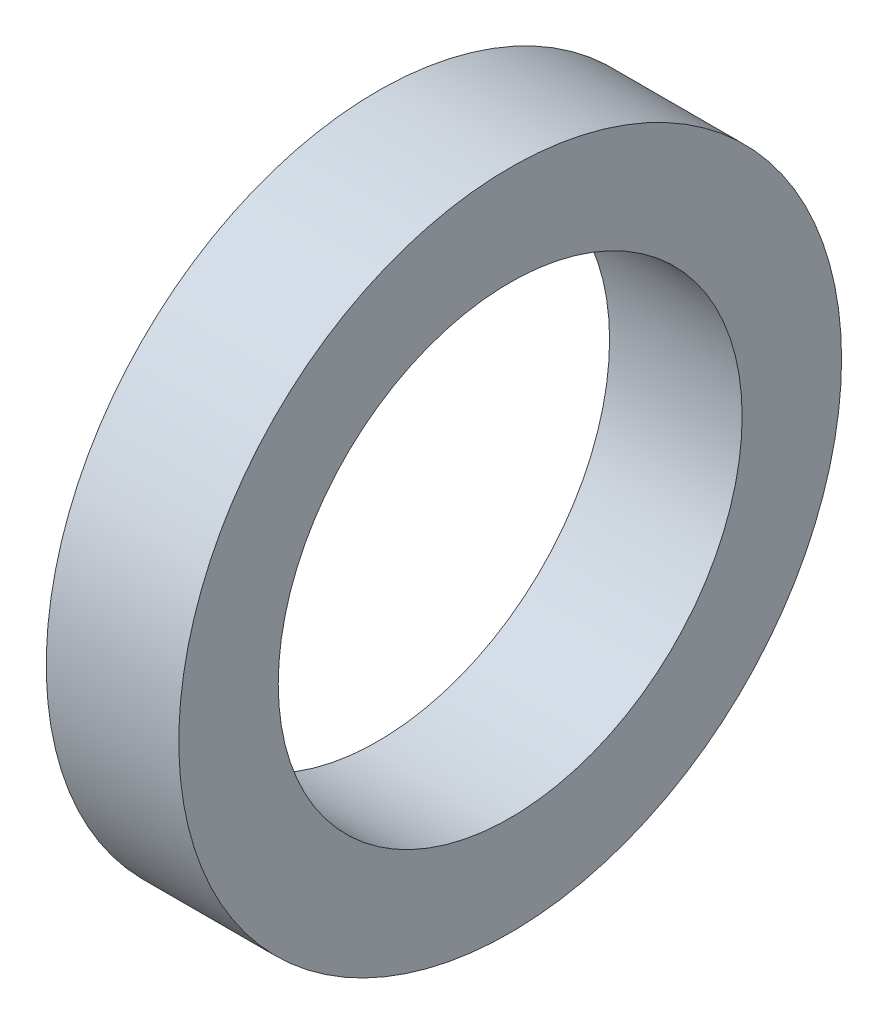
ISO-10303-21;
HEADER;
FILE_DESCRIPTION(('STEP AP214'),'2;1');
FILE_NAME('part.step','',(''),(''),'','','');
FILE_SCHEMA(('AUTOMOTIVE_DESIGN { 1 0 10303 214 1 1 1 1 }'));
ENDSEC;
DATA;
#1=APPLICATION_CONTEXT('core data for automotive mechanical design processes');
#2=APPLICATION_PROTOCOL_DEFINITION('international standard','automotive_design',2000,#1);
#3=PRODUCT_CONTEXT('',#1,'mechanical');
#4=PRODUCT('Part','Part','',(#3));
#5=PRODUCT_RELATED_PRODUCT_CATEGORY('part','',(#4));
#6=PRODUCT_DEFINITION_FORMATION('','',#4);
#7=PRODUCT_DEFINITION_CONTEXT('part definition',#1,'design');
#8=PRODUCT_DEFINITION('design','',#6,#7);
#9=PRODUCT_DEFINITION_SHAPE('','',#8);
#10=(LENGTH_UNIT() NAMED_UNIT(*) SI_UNIT(.MILLI.,.METRE.));
#11=(NAMED_UNIT(*) PLANE_ANGLE_UNIT() SI_UNIT($,.RADIAN.));
#12=(NAMED_UNIT(*) SI_UNIT($,.STERADIAN.) SOLID_ANGLE_UNIT());
#13=UNCERTAINTY_MEASURE_WITH_UNIT(LENGTH_MEASURE(1.E-05),#10,'distance_accuracy_value','');
#14=(GEOMETRIC_REPRESENTATION_CONTEXT(3) GLOBAL_UNCERTAINTY_ASSIGNED_CONTEXT((#13)) GLOBAL_UNIT_ASSIGNED_CONTEXT((#10,
#11,#12)) REPRESENTATION_CONTEXT('',''));
#15=CARTESIAN_POINT('',(0.,0.,0.));
#16=DIRECTION('',(0.,0.,1.));
#17=DIRECTION('',(1.,0.,0.));
#18=AXIS2_PLACEMENT_3D('',#15,#16,#17);
#19=CARTESIAN_POINT('',(3.,0.,0.));
#20=DIRECTION('',(1.,0.,0.));
#21=DIRECTION('',(0.,0.,-1.));
#22=AXIS2_PLACEMENT_3D('',#19,#20,#21);
#23=PLANE('',#22);
#24=CARTESIAN_POINT('',(3.,0.,0.));
#25=DIRECTION('',(1.,0.,0.));
#26=DIRECTION('',(0.,0.,-1.));
#27=AXIS2_PLACEMENT_3D('',#24,#25,#26);
#28=CIRCLE('',#27,5.25);
#29=CARTESIAN_POINT('',(3.,0.,-5.25));
#30=VERTEX_POINT('',#29);
#31=EDGE_CURVE('E28',#30,#30,#28,.F.);
#32=ORIENTED_EDGE('',*,*,#31,.T.);
#33=EDGE_LOOP('',(#32));
#34=FACE_BOUND('',#33,.T.);
#35=CARTESIAN_POINT('',(3.,0.,0.));
#36=DIRECTION('',(1.,0.,0.));
#37=DIRECTION('',(0.,0.,-1.));
#38=AXIS2_PLACEMENT_3D('',#35,#36,#37);
#39=CIRCLE('',#38,7.5);
#40=CARTESIAN_POINT('',(3.,0.,-7.5));
#41=VERTEX_POINT('',#40);
#42=EDGE_CURVE('E19',#41,#41,#39,.F.);
#43=ORIENTED_EDGE('',*,*,#42,.F.);
#44=EDGE_LOOP('',(#43));
#45=FACE_BOUND('',#44,.T.);
#46=ADVANCED_FACE('F15',(#34,#45),#23,.T.);
#47=CARTESIAN_POINT('',(0.,0.,0.));
#48=DIRECTION('',(1.,0.,0.));
#49=DIRECTION('',(0.,0.,-1.));
#50=AXIS2_PLACEMENT_3D('',#47,#48,#49);
#51=CYLINDRICAL_SURFACE('',#50,7.5);
#52=ORIENTED_EDGE('',*,*,#42,.T.);
#53=EDGE_LOOP('',(#52));
#54=FACE_BOUND('',#53,.T.);
#55=CARTESIAN_POINT('',(0.,0.,0.));
#56=DIRECTION('',(1.,0.,0.));
#57=DIRECTION('',(0.,0.,-1.));
#58=AXIS2_PLACEMENT_3D('',#55,#56,#57);
#59=CIRCLE('',#58,7.5);
#60=CARTESIAN_POINT('',(0.,0.,-7.5));
#61=VERTEX_POINT('',#60);
#62=EDGE_CURVE('E23',#61,#61,#59,.T.);
#63=ORIENTED_EDGE('',*,*,#62,.T.);
#64=EDGE_LOOP('',(#63));
#65=FACE_BOUND('',#64,.T.);
#66=ADVANCED_FACE('F36',(#54,#65),#51,.T.);
#67=CARTESIAN_POINT('',(0.,0.,0.));
#68=DIRECTION('',(1.,0.,0.));
#69=DIRECTION('',(0.,0.,-1.));
#70=AXIS2_PLACEMENT_3D('',#67,#68,#69);
#71=CYLINDRICAL_SURFACE('',#70,5.25);
#72=ORIENTED_EDGE('',*,*,#31,.F.);
#73=EDGE_LOOP('',(#72));
#74=FACE_BOUND('',#73,.T.);
#75=CARTESIAN_POINT('',(0.,0.,0.));
#76=DIRECTION('',(1.,0.,0.));
#77=DIRECTION('',(0.,0.,-1.));
#78=AXIS2_PLACEMENT_3D('',#75,#76,#77);
#79=CIRCLE('',#78,5.25);
#80=CARTESIAN_POINT('',(0.,0.,-5.25));
#81=VERTEX_POINT('',#80);
#82=EDGE_CURVE('E10',#81,#81,#79,.F.);
#83=ORIENTED_EDGE('',*,*,#82,.T.);
#84=EDGE_LOOP('',(#83));
#85=FACE_BOUND('',#84,.T.);
#86=ADVANCED_FACE('F45',(#74,#85),#71,.F.);
#87=CARTESIAN_POINT('',(0.,0.,0.));
#88=DIRECTION('',(1.,0.,0.));
#89=DIRECTION('',(0.,0.,-1.));
#90=AXIS2_PLACEMENT_3D('',#87,#88,#89);
#91=PLANE('',#90);
#92=ORIENTED_EDGE('',*,*,#82,.F.);
#93=EDGE_LOOP('',(#92));
#94=FACE_BOUND('',#93,.T.);
#95=ORIENTED_EDGE('',*,*,#62,.F.);
#96=EDGE_LOOP('',(#95));
#97=FACE_BOUND('',#96,.T.);
#98=ADVANCED_FACE('F17',(#94,#97),#91,.F.);
#99=CLOSED_SHELL('',(#46,#66,#86,#98));
#100=MANIFOLD_SOLID_BREP('B1',#99);
#101=ADVANCED_BREP_SHAPE_REPRESENTATION('',(#18,#100),#14);
#102=SHAPE_DEFINITION_REPRESENTATION(#9,#101);
ENDSEC;
END-ISO-10303-21;
